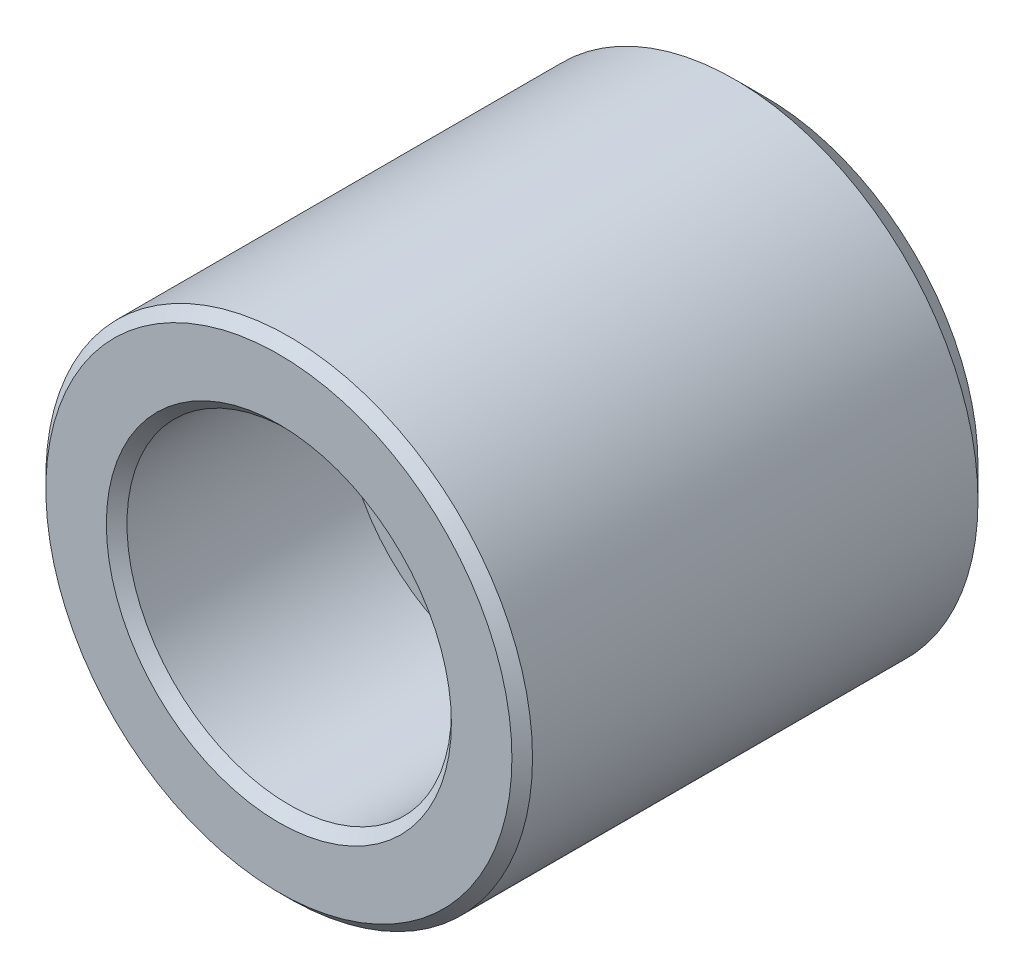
ISO-10303-21;
HEADER;
FILE_DESCRIPTION(('STEP AP214'),'2;1');
FILE_NAME('part.step','',(''),(''),'','','');
FILE_SCHEMA(('AUTOMOTIVE_DESIGN { 1 0 10303 214 1 1 1 1 }'));
ENDSEC;
DATA;
#1=APPLICATION_CONTEXT('core data for automotive mechanical design processes');
#2=APPLICATION_PROTOCOL_DEFINITION('international standard','automotive_design',2000,#1);
#3=PRODUCT_CONTEXT('',#1,'mechanical');
#4=PRODUCT('Part','Part','',(#3));
#5=PRODUCT_RELATED_PRODUCT_CATEGORY('part','',(#4));
#6=PRODUCT_DEFINITION_FORMATION('','',#4);
#7=PRODUCT_DEFINITION_CONTEXT('part definition',#1,'design');
#8=PRODUCT_DEFINITION('design','',#6,#7);
#9=PRODUCT_DEFINITION_SHAPE('','',#8);
#10=(LENGTH_UNIT() NAMED_UNIT(*) SI_UNIT(.MILLI.,.METRE.));
#11=(NAMED_UNIT(*) PLANE_ANGLE_UNIT() SI_UNIT($,.RADIAN.));
#12=(NAMED_UNIT(*) SI_UNIT($,.STERADIAN.) SOLID_ANGLE_UNIT());
#13=UNCERTAINTY_MEASURE_WITH_UNIT(LENGTH_MEASURE(1.E-05),#10,'distance_accuracy_value','');
#14=(GEOMETRIC_REPRESENTATION_CONTEXT(3) GLOBAL_UNCERTAINTY_ASSIGNED_CONTEXT((#13)) GLOBAL_UNIT_ASSIGNED_CONTEXT((#10,
#11,#12)) REPRESENTATION_CONTEXT('',''));
#15=CARTESIAN_POINT('',(0.,0.,0.));
#16=DIRECTION('',(0.,0.,1.));
#17=DIRECTION('',(1.,0.,0.));
#18=AXIS2_PLACEMENT_3D('',#15,#16,#17);
#19=CARTESIAN_POINT('',(0.,0.,12.));
#20=DIRECTION('',(0.,0.,1.));
#21=DIRECTION('',(1.,0.,0.));
#22=AXIS2_PLACEMENT_3D('',#19,#20,#21);
#23=CYLINDRICAL_SURFACE('',#22,2.25);
#24=CARTESIAN_POINT('',(0.,0.,0.2519));
#25=DIRECTION('',(0.,0.,1.));
#26=DIRECTION('',(1.,0.,0.));
#27=AXIS2_PLACEMENT_3D('',#24,#25,#26);
#28=CIRCLE('',#27,2.25);
#29=CARTESIAN_POINT('',(2.25,0.,0.2519));
#30=VERTEX_POINT('',#29);
#31=EDGE_CURVE('E32',#30,#30,#28,.T.);
#32=ORIENTED_EDGE('',*,*,#31,.F.);
#33=EDGE_LOOP('',(#32));
#34=FACE_BOUND('',#33,.T.);
#35=CARTESIAN_POINT('',(0.,0.,6.412));
#36=DIRECTION('',(0.,0.,1.));
#37=DIRECTION('',(1.,0.,0.));
#38=AXIS2_PLACEMENT_3D('',#35,#36,#37);
#39=CIRCLE('',#38,2.25);
#40=CARTESIAN_POINT('',(2.25,0.,6.412));
#41=VERTEX_POINT('',#40);
#42=EDGE_CURVE('E30',#41,#41,#39,.F.);
#43=ORIENTED_EDGE('',*,*,#42,.F.);
#44=EDGE_LOOP('',(#43));
#45=FACE_BOUND('',#44,.T.);
#46=ADVANCED_FACE('F12',(#34,#45),#23,.F.);
#47=CARTESIAN_POINT('',(0.,0.,0.));
#48=DIRECTION('',(0.,0.,1.));
#49=DIRECTION('',(1.,0.,0.));
#50=AXIS2_PLACEMENT_3D('',#47,#48,#49);
#51=CYLINDRICAL_SURFACE('',#50,6.);
#52=CARTESIAN_POINT('',(0.,0.,0.762));
#53=DIRECTION('',(0.,0.,1.));
#54=DIRECTION('',(1.,0.,0.));
#55=AXIS2_PLACEMENT_3D('',#52,#53,#54);
#56=CIRCLE('',#55,6.);
#57=CARTESIAN_POINT('',(6.,0.,0.762));
#58=VERTEX_POINT('',#57);
#59=EDGE_CURVE('E27',#58,#58,#56,.T.);
#60=ORIENTED_EDGE('',*,*,#59,.T.);
#61=EDGE_LOOP('',(#60));
#62=FACE_BOUND('',#61,.T.);
#63=CARTESIAN_POINT('',(0.,0.,11.746));
#64=DIRECTION('',(0.,0.,1.));
#65=DIRECTION('',(1.,0.,0.));
#66=AXIS2_PLACEMENT_3D('',#63,#64,#65);
#67=CIRCLE('',#66,6.);
#68=CARTESIAN_POINT('',(6.,0.,11.746));
#69=VERTEX_POINT('',#68);
#70=EDGE_CURVE('E37',#69,#69,#67,.F.);
#71=ORIENTED_EDGE('',*,*,#70,.T.);
#72=EDGE_LOOP('',(#71));
#73=FACE_BOUND('',#72,.T.);
#74=ADVANCED_FACE('F68',(#62,#73),#51,.T.);
#75=CARTESIAN_POINT('',(0.,0.,0.));
#76=DIRECTION('',(0.,0.,1.));
#77=DIRECTION('',(1.,0.,0.));
#78=AXIS2_PLACEMENT_3D('',#75,#76,#77);
#79=PLANE('',#78);
#80=CARTESIAN_POINT('',(0.,0.,0.));
#81=DIRECTION('',(0.,0.,1.));
#82=DIRECTION('',(1.,0.,0.));
#83=AXIS2_PLACEMENT_3D('',#80,#81,#82);
#84=CIRCLE('',#83,2.5019);
#85=CARTESIAN_POINT('',(2.5019,0.,0.));
#86=VERTEX_POINT('',#85);
#87=EDGE_CURVE('E43',#86,#86,#84,.T.);
#88=ORIENTED_EDGE('',*,*,#87,.T.);
#89=EDGE_LOOP('',(#88));
#90=FACE_BOUND('',#89,.T.);
#91=CARTESIAN_POINT('',(0.,0.,0.));
#92=DIRECTION('',(0.,0.,1.));
#93=DIRECTION('',(1.,0.,0.));
#94=AXIS2_PLACEMENT_3D('',#91,#92,#93);
#95=CIRCLE('',#94,5.238);
#96=CARTESIAN_POINT('',(5.238,0.,0.));
#97=VERTEX_POINT('',#96);
#98=EDGE_CURVE('E23',#97,#97,#95,.F.);
#99=ORIENTED_EDGE('',*,*,#98,.T.);
#100=EDGE_LOOP('',(#99));
#101=FACE_BOUND('',#100,.T.);
#102=ADVANCED_FACE('F74',(#90,#101),#79,.F.);
#103=CARTESIAN_POINT('',(0.,0.,12.));
#104=DIRECTION('',(0.,0.,1.));
#105=DIRECTION('',(1.,0.,0.));
#106=AXIS2_PLACEMENT_3D('',#103,#104,#105);
#107=PLANE('',#106);
#108=CARTESIAN_POINT('',(0.,0.,12.));
#109=DIRECTION('',(0.,0.,1.));
#110=DIRECTION('',(1.,0.,0.));
#111=AXIS2_PLACEMENT_3D('',#108,#109,#110);
#112=CIRCLE('',#111,4.254);
#113=CARTESIAN_POINT('',(4.254,0.,12.));
#114=VERTEX_POINT('',#113);
#115=EDGE_CURVE('E8',#114,#114,#112,.F.);
#116=ORIENTED_EDGE('',*,*,#115,.T.);
#117=EDGE_LOOP('',(#116));
#118=FACE_BOUND('',#117,.T.);
#119=CARTESIAN_POINT('',(0.,0.,12.));
#120=DIRECTION('',(0.,0.,1.));
#121=DIRECTION('',(1.,0.,0.));
#122=AXIS2_PLACEMENT_3D('',#119,#120,#121);
#123=CIRCLE('',#122,5.746);
#124=CARTESIAN_POINT('',(5.746,0.,12.));
#125=VERTEX_POINT('',#124);
#126=EDGE_CURVE('E40',#125,#125,#123,.T.);
#127=ORIENTED_EDGE('',*,*,#126,.T.);
#128=EDGE_LOOP('',(#127));
#129=FACE_BOUND('',#128,.T.);
#130=ADVANCED_FACE('F86',(#118,#129),#107,.T.);
#131=CARTESIAN_POINT('',(0.,0.,12.));
#132=DIRECTION('',(0.,0.,-1.));
#133=DIRECTION('',(-1.,0.,0.));
#134=AXIS2_PLACEMENT_3D('',#131,#132,#133);
#135=CONICAL_SURFACE('',#134,5.746,0.78539816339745);
#136=ORIENTED_EDGE('',*,*,#70,.F.);
#137=EDGE_LOOP('',(#136));
#138=FACE_BOUND('',#137,.T.);
#139=ORIENTED_EDGE('',*,*,#126,.F.);
#140=EDGE_LOOP('',(#139));
#141=FACE_BOUND('',#140,.T.);
#142=ADVANCED_FACE('F89',(#138,#141),#135,.T.);
#143=CARTESIAN_POINT('',(0.,0.,0.762));
#144=DIRECTION('',(0.,0.,1.));
#145=DIRECTION('',(1.,0.,0.));
#146=AXIS2_PLACEMENT_3D('',#143,#144,#145);
#147=CONICAL_SURFACE('',#146,6.,0.785398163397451);
#148=ORIENTED_EDGE('',*,*,#98,.F.);
#149=EDGE_LOOP('',(#148));
#150=FACE_BOUND('',#149,.T.);
#151=ORIENTED_EDGE('',*,*,#59,.F.);
#152=EDGE_LOOP('',(#151));
#153=FACE_BOUND('',#152,.T.);
#154=ADVANCED_FACE('F82',(#150,#153),#147,.T.);
#155=CARTESIAN_POINT('',(0.,0.,0.2519));
#156=DIRECTION('',(0.,0.,-1.));
#157=DIRECTION('',(-1.,0.,0.));
#158=AXIS2_PLACEMENT_3D('',#155,#156,#157);
#159=CONICAL_SURFACE('',#158,2.25,0.785398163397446);
#160=ORIENTED_EDGE('',*,*,#87,.F.);
#161=EDGE_LOOP('',(#160));
#162=FACE_BOUND('',#161,.T.);
#163=ORIENTED_EDGE('',*,*,#31,.T.);
#164=EDGE_LOOP('',(#163));
#165=FACE_BOUND('',#164,.T.);
#166=ADVANCED_FACE('F64',(#162,#165),#159,.F.);
#167=CARTESIAN_POINT('',(0.,0.,6.412));
#168=DIRECTION('',(0.,0.,1.));
#169=DIRECTION('',(1.,0.,0.));
#170=AXIS2_PLACEMENT_3D('',#167,#168,#169);
#171=PLANE('',#170);
#172=CARTESIAN_POINT('',(0.,0.,6.412));
#173=DIRECTION('',(0.,0.,1.));
#174=DIRECTION('',(1.,0.,0.));
#175=AXIS2_PLACEMENT_3D('',#172,#173,#174);
#176=CIRCLE('',#175,4.);
#177=CARTESIAN_POINT('',(4.,0.,6.412));
#178=VERTEX_POINT('',#177);
#179=EDGE_CURVE('E33',#178,#178,#176,.T.);
#180=ORIENTED_EDGE('',*,*,#179,.T.);
#181=EDGE_LOOP('',(#180));
#182=FACE_BOUND('',#181,.T.);
#183=ORIENTED_EDGE('',*,*,#42,.T.);
#184=EDGE_LOOP('',(#183));
#185=FACE_BOUND('',#184,.T.);
#186=ADVANCED_FACE('F51',(#182,#185),#171,.T.);
#187=CARTESIAN_POINT('',(0.,0.,6.412));
#188=DIRECTION('',(0.,0.,1.));
#189=DIRECTION('',(1.,0.,0.));
#190=AXIS2_PLACEMENT_3D('',#187,#188,#189);
#191=CYLINDRICAL_SURFACE('',#190,4.);
#192=CARTESIAN_POINT('',(0.,0.,11.746));
#193=DIRECTION('',(0.,0.,1.));
#194=DIRECTION('',(1.,0.,0.));
#195=AXIS2_PLACEMENT_3D('',#192,#193,#194);
#196=CIRCLE('',#195,4.);
#197=CARTESIAN_POINT('',(4.,0.,11.746));
#198=VERTEX_POINT('',#197);
#199=EDGE_CURVE('E19',#198,#198,#196,.T.);
#200=ORIENTED_EDGE('',*,*,#199,.T.);
#201=EDGE_LOOP('',(#200));
#202=FACE_BOUND('',#201,.T.);
#203=ORIENTED_EDGE('',*,*,#179,.F.);
#204=EDGE_LOOP('',(#203));
#205=FACE_BOUND('',#204,.T.);
#206=ADVANCED_FACE('F54',(#202,#205),#191,.F.);
#207=CARTESIAN_POINT('',(0.,0.,11.746));
#208=DIRECTION('',(0.,0.,1.));
#209=DIRECTION('',(1.,0.,0.));
#210=AXIS2_PLACEMENT_3D('',#207,#208,#209);
#211=CONICAL_SURFACE('',#210,4.,0.785398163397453);
#212=ORIENTED_EDGE('',*,*,#115,.F.);
#213=EDGE_LOOP('',(#212));
#214=FACE_BOUND('',#213,.T.);
#215=ORIENTED_EDGE('',*,*,#199,.F.);
#216=EDGE_LOOP('',(#215));
#217=FACE_BOUND('',#216,.T.);
#218=ADVANCED_FACE('F14',(#214,#217),#211,.F.);
#219=CLOSED_SHELL('',(#46,#74,#102,#130,#142,#154,#166,#186,#206,#218));
#220=MANIFOLD_SOLID_BREP('B1',#219);
#221=ADVANCED_BREP_SHAPE_REPRESENTATION('',(#18,#220),#14);
#222=SHAPE_DEFINITION_REPRESENTATION(#9,#221);
ENDSEC;
END-ISO-10303-21;
